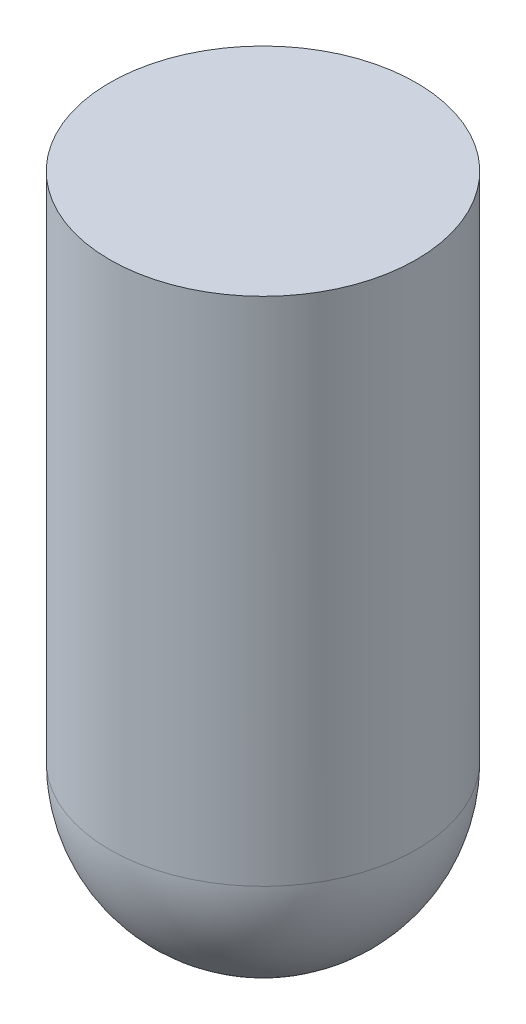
ISO-10303-21;
HEADER;
FILE_DESCRIPTION(('STEP AP214'),'2;1');
FILE_NAME('part.step','',(''),(''),'','','');
FILE_SCHEMA(('AUTOMOTIVE_DESIGN { 1 0 10303 214 1 1 1 1 }'));
ENDSEC;
DATA;
#1=APPLICATION_CONTEXT('core data for automotive mechanical design processes');
#2=APPLICATION_PROTOCOL_DEFINITION('international standard','automotive_design',2000,#1);
#3=PRODUCT_CONTEXT('',#1,'mechanical');
#4=PRODUCT('Part','Part','',(#3));
#5=PRODUCT_RELATED_PRODUCT_CATEGORY('part','',(#4));
#6=PRODUCT_DEFINITION_FORMATION('','',#4);
#7=PRODUCT_DEFINITION_CONTEXT('part definition',#1,'design');
#8=PRODUCT_DEFINITION('design','',#6,#7);
#9=PRODUCT_DEFINITION_SHAPE('','',#8);
#10=(LENGTH_UNIT() NAMED_UNIT(*) SI_UNIT(.MILLI.,.METRE.));
#11=(NAMED_UNIT(*) PLANE_ANGLE_UNIT() SI_UNIT($,.RADIAN.));
#12=(NAMED_UNIT(*) SI_UNIT($,.STERADIAN.) SOLID_ANGLE_UNIT());
#13=UNCERTAINTY_MEASURE_WITH_UNIT(LENGTH_MEASURE(1.E-05),#10,'distance_accuracy_value','');
#14=(GEOMETRIC_REPRESENTATION_CONTEXT(3) GLOBAL_UNCERTAINTY_ASSIGNED_CONTEXT((#13)) GLOBAL_UNIT_ASSIGNED_CONTEXT((#10,
#11,#12)) REPRESENTATION_CONTEXT('',''));
#15=CARTESIAN_POINT('',(0.,0.,0.));
#16=DIRECTION('',(0.,0.,1.));
#17=DIRECTION('',(1.,0.,0.));
#18=AXIS2_PLACEMENT_3D('',#15,#16,#17);
#19=CARTESIAN_POINT('',(14.925,122.8825,0.));
#20=DIRECTION('',(0.,1.,0.));
#21=DIRECTION('',(-1.,0.,0.));
#22=AXIS2_PLACEMENT_3D('',#19,#20,#21);
#23=CYLINDRICAL_SURFACE('',#22,1.4925);
#24=CARTESIAN_POINT('',(14.925,124.375,0.));
#25=DIRECTION('',(0.,1.,0.));
#26=DIRECTION('',(0.,0.,1.));
#27=AXIS2_PLACEMENT_3D('',#24,#25,#26);
#28=CIRCLE('',#27,1.4925);
#29=CARTESIAN_POINT('',(14.925,124.375,1.4925));
#30=VERTEX_POINT('',#29);
#31=EDGE_CURVE('E10',#30,#30,#28,.T.);
#32=ORIENTED_EDGE('',*,*,#31,.T.);
#33=EDGE_LOOP('',(#32));
#34=FACE_BOUND('',#33,.T.);
#35=CARTESIAN_POINT('',(14.925,129.35,0.));
#36=DIRECTION('',(0.,-1.,0.));
#37=DIRECTION('',(1.,0.,0.));
#38=AXIS2_PLACEMENT_3D('',#35,#36,#37);
#39=CIRCLE('',#38,1.4925);
#40=CARTESIAN_POINT('',(16.4175,129.35,0.));
#41=VERTEX_POINT('',#40);
#42=EDGE_CURVE('E21',#41,#41,#39,.T.);
#43=ORIENTED_EDGE('',*,*,#42,.T.);
#44=EDGE_LOOP('',(#43));
#45=FACE_BOUND('',#44,.T.);
#46=ADVANCED_FACE('F14',(#34,#45),#23,.T.);
#47=CARTESIAN_POINT('',(14.925,129.35,0.));
#48=DIRECTION('',(0.,-1.,0.));
#49=DIRECTION('',(1.,0.,0.));
#50=AXIS2_PLACEMENT_3D('',#47,#48,#49);
#51=PLANE('',#50);
#52=ORIENTED_EDGE('',*,*,#42,.F.);
#53=EDGE_LOOP('',(#52));
#54=FACE_BOUND('',#53,.T.);
#55=ADVANCED_FACE('F47',(#54),#51,.F.);
#56=CARTESIAN_POINT('',(14.925,124.375,0.));
#57=DIRECTION('',(0.,0.,1.));
#58=DIRECTION('',(1.,0.,0.));
#59=AXIS2_PLACEMENT_3D('',#56,#57,#58);
#60=SPHERICAL_SURFACE('',#59,1.4925);
#61=CARTESIAN_POINT('',(14.925,124.375,0.));
#62=DIRECTION('',(0.,1.,0.));
#63=DIRECTION('',(0.,0.,1.));
#64=AXIS2_PLACEMENT_3D('',#61,#62,#63);
#65=SPHERICAL_SURFACE('',#64,1.4925);
#66=ORIENTED_EDGE('',*,*,#31,.F.);
#67=EDGE_LOOP('',(#66));
#68=FACE_BOUND('',#67,.T.);
#69=ADVANCED_FACE('F49',(#68),#65,.T.);
#70=CLOSED_SHELL('',(#46,#55,#69));
#71=MANIFOLD_SOLID_BREP('B1',#70);
#72=ADVANCED_BREP_SHAPE_REPRESENTATION('',(#18,#71),#14);
#73=SHAPE_DEFINITION_REPRESENTATION(#9,#72);
ENDSEC;
END-ISO-10303-21;
